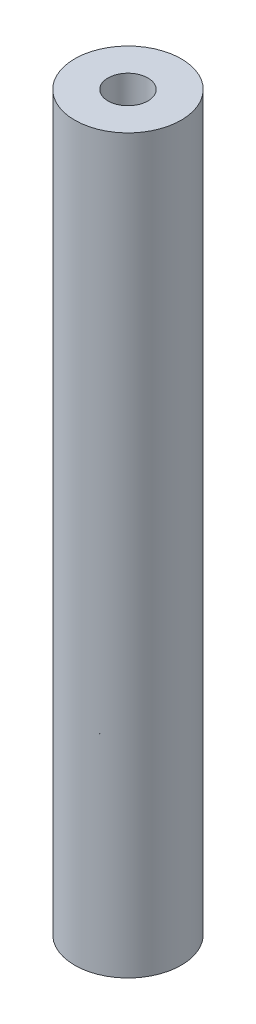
from build123d import *

# Parameters (mm, degrees)
SKETCH_1_R          = 4
EXTRUDE_1_DEPTH     = 55
SKETCH_2_R          = 1.5
CUT_EXTRUDE_1_DEPTH = 55


with BuildPart() as part:
    # Sketch 1 → Extrude 1 (new body)
    with BuildSketch(Plane(origin=(0, 0, 0), x_dir=(1, 0, 0), z_dir=(0, 1, 0))):
        with Locations(Location((0, 0, 0), (0, 0, 270))):
            Circle(SKETCH_1_R)
    extrude(amount=EXTRUDE_1_DEPTH)

    # Sketch 2 → Cut-Extrude 1 (cut)
    with BuildSketch(Plane.XZ):
        with Locations(Location((0, 0, 0), (0, 0, 270))):
            Circle(SKETCH_2_R)
    extrude(amount=-CUT_EXTRUDE_1_DEPTH, mode=Mode.SUBTRACT)


solid = part.part
